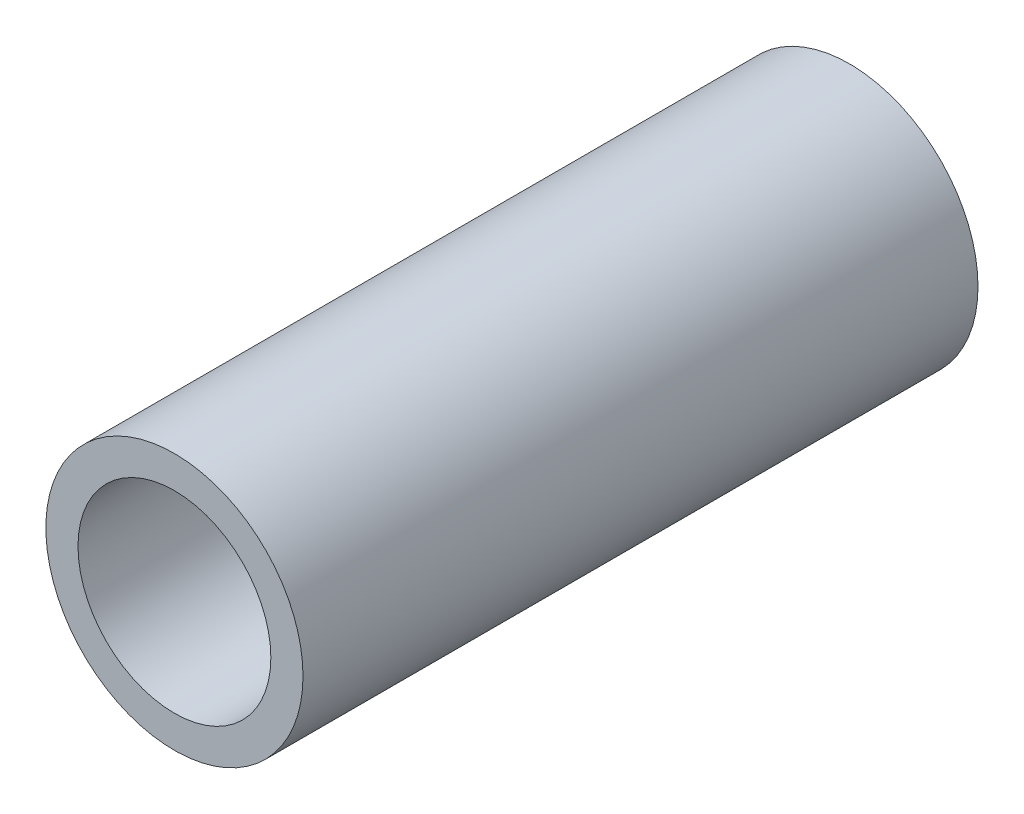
ISO-10303-21;
HEADER;
FILE_DESCRIPTION(('STEP AP214'),'2;1');
FILE_NAME('part.step','',(''),(''),'','','');
FILE_SCHEMA(('AUTOMOTIVE_DESIGN { 1 0 10303 214 1 1 1 1 }'));
ENDSEC;
DATA;
#1=APPLICATION_CONTEXT('core data for automotive mechanical design processes');
#2=APPLICATION_PROTOCOL_DEFINITION('international standard','automotive_design',2000,#1);
#3=PRODUCT_CONTEXT('',#1,'mechanical');
#4=PRODUCT('Part','Part','',(#3));
#5=PRODUCT_RELATED_PRODUCT_CATEGORY('part','',(#4));
#6=PRODUCT_DEFINITION_FORMATION('','',#4);
#7=PRODUCT_DEFINITION_CONTEXT('part definition',#1,'design');
#8=PRODUCT_DEFINITION('design','',#6,#7);
#9=PRODUCT_DEFINITION_SHAPE('','',#8);
#10=(LENGTH_UNIT() NAMED_UNIT(*) SI_UNIT(.MILLI.,.METRE.));
#11=(NAMED_UNIT(*) PLANE_ANGLE_UNIT() SI_UNIT($,.RADIAN.));
#12=(NAMED_UNIT(*) SI_UNIT($,.STERADIAN.) SOLID_ANGLE_UNIT());
#13=UNCERTAINTY_MEASURE_WITH_UNIT(LENGTH_MEASURE(1.E-05),#10,'distance_accuracy_value','');
#14=(GEOMETRIC_REPRESENTATION_CONTEXT(3) GLOBAL_UNCERTAINTY_ASSIGNED_CONTEXT((#13)) GLOBAL_UNIT_ASSIGNED_CONTEXT((#10,
#11,#12)) REPRESENTATION_CONTEXT('',''));
#15=CARTESIAN_POINT('',(0.,0.,0.));
#16=DIRECTION('',(0.,0.,1.));
#17=DIRECTION('',(1.,0.,0.));
#18=AXIS2_PLACEMENT_3D('',#15,#16,#17);
#19=CARTESIAN_POINT('',(0.,0.,31.5));
#20=DIRECTION('',(0.,0.,1.));
#21=DIRECTION('',(1.,0.,0.));
#22=AXIS2_PLACEMENT_3D('',#19,#20,#21);
#23=PLANE('',#22);
#24=CARTESIAN_POINT('',(0.,0.,31.5));
#25=DIRECTION('',(0.,0.,1.));
#26=DIRECTION('',(1.,0.,0.));
#27=AXIS2_PLACEMENT_3D('',#24,#25,#26);
#28=CIRCLE('',#27,4.5);
#29=CARTESIAN_POINT('',(4.5,0.,31.5));
#30=VERTEX_POINT('',#29);
#31=EDGE_CURVE('E24',#30,#30,#28,.T.);
#32=ORIENTED_EDGE('',*,*,#31,.F.);
#33=EDGE_LOOP('',(#32));
#34=FACE_BOUND('',#33,.T.);
#35=CARTESIAN_POINT('',(0.,0.,31.5));
#36=DIRECTION('',(0.,0.,1.));
#37=DIRECTION('',(1.,0.,0.));
#38=AXIS2_PLACEMENT_3D('',#35,#36,#37);
#39=CIRCLE('',#38,6.);
#40=CARTESIAN_POINT('',(6.,0.,31.5));
#41=VERTEX_POINT('',#40);
#42=EDGE_CURVE('E57',#41,#41,#39,.T.);
#43=ORIENTED_EDGE('',*,*,#42,.T.);
#44=EDGE_LOOP('',(#43));
#45=FACE_BOUND('',#44,.T.);
#46=ADVANCED_FACE('F16',(#34,#45),#23,.T.);
#47=CARTESIAN_POINT('',(0.,0.,0.));
#48=DIRECTION('',(0.,0.,1.));
#49=DIRECTION('',(1.,0.,0.));
#50=AXIS2_PLACEMENT_3D('',#47,#48,#49);
#51=PLANE('',#50);
#52=CARTESIAN_POINT('',(0.,0.,0.));
#53=DIRECTION('',(0.,0.,1.));
#54=DIRECTION('',(1.,0.,0.));
#55=AXIS2_PLACEMENT_3D('',#52,#53,#54);
#56=CIRCLE('',#55,4.5);
#57=CARTESIAN_POINT('',(4.5,0.,0.));
#58=VERTEX_POINT('',#57);
#59=EDGE_CURVE('E10',#58,#58,#56,.T.);
#60=ORIENTED_EDGE('',*,*,#59,.T.);
#61=EDGE_LOOP('',(#60));
#62=FACE_BOUND('',#61,.T.);
#63=CARTESIAN_POINT('',(0.,0.,0.));
#64=DIRECTION('',(0.,0.,1.));
#65=DIRECTION('',(1.,0.,0.));
#66=AXIS2_PLACEMENT_3D('',#63,#64,#65);
#67=CIRCLE('',#66,6.);
#68=CARTESIAN_POINT('',(6.,0.,0.));
#69=VERTEX_POINT('',#68);
#70=EDGE_CURVE('E56',#69,#69,#67,.T.);
#71=ORIENTED_EDGE('',*,*,#70,.F.);
#72=EDGE_LOOP('',(#71));
#73=FACE_BOUND('',#72,.T.);
#74=ADVANCED_FACE('F88',(#62,#73),#51,.F.);
#75=CARTESIAN_POINT('',(0.,0.,0.));
#76=DIRECTION('',(0.,0.,-1.));
#77=DIRECTION('',(1.,0.,0.));
#78=AXIS2_PLACEMENT_3D('',#75,#76,#77);
#79=CYLINDRICAL_SURFACE('',#78,4.5);
#80=DIRECTION('',(0.,0.,1.));
#81=VECTOR('',#80,1.);
#82=CARTESIAN_POINT('',(4.5,0.,0.));
#83=LINE('',#82,#81);
#84=EDGE_CURVE('E63',#58,#30,#83,.T.);
#85=ORIENTED_EDGE('',*,*,#84,.T.);
#86=ORIENTED_EDGE('',*,*,#31,.T.);
#87=ORIENTED_EDGE('',*,*,#84,.F.);
#88=ORIENTED_EDGE('',*,*,#59,.F.);
#89=EDGE_LOOP('',(#85,#86,#87,#88));
#90=FACE_BOUND('',#89,.T.);
#91=ADVANCED_FACE('F79',(#90),#79,.F.);
#92=CARTESIAN_POINT('',(0.,0.,0.));
#93=DIRECTION('',(0.,0.,-1.));
#94=DIRECTION('',(1.,0.,0.));
#95=AXIS2_PLACEMENT_3D('',#92,#93,#94);
#96=CYLINDRICAL_SURFACE('',#95,6.);
#97=ORIENTED_EDGE('',*,*,#70,.T.);
#98=DIRECTION('',(0.,0.,1.));
#99=VECTOR('',#98,1.);
#100=CARTESIAN_POINT('',(6.,0.,0.));
#101=LINE('',#100,#99);
#102=EDGE_CURVE('E53',#69,#41,#101,.T.);
#103=ORIENTED_EDGE('',*,*,#102,.T.);
#104=ORIENTED_EDGE('',*,*,#42,.F.);
#105=ORIENTED_EDGE('',*,*,#102,.F.);
#106=EDGE_LOOP('',(#97,#103,#104,#105));
#107=FACE_BOUND('',#106,.T.);
#108=ADVANCED_FACE('F54',(#107),#96,.T.);
#109=CLOSED_SHELL('',(#46,#74,#91,#108));
#110=MANIFOLD_SOLID_BREP('B1',#109);
#111=ADVANCED_BREP_SHAPE_REPRESENTATION('',(#18,#110),#14);
#112=SHAPE_DEFINITION_REPRESENTATION(#9,#111);
ENDSEC;
END-ISO-10303-21;
